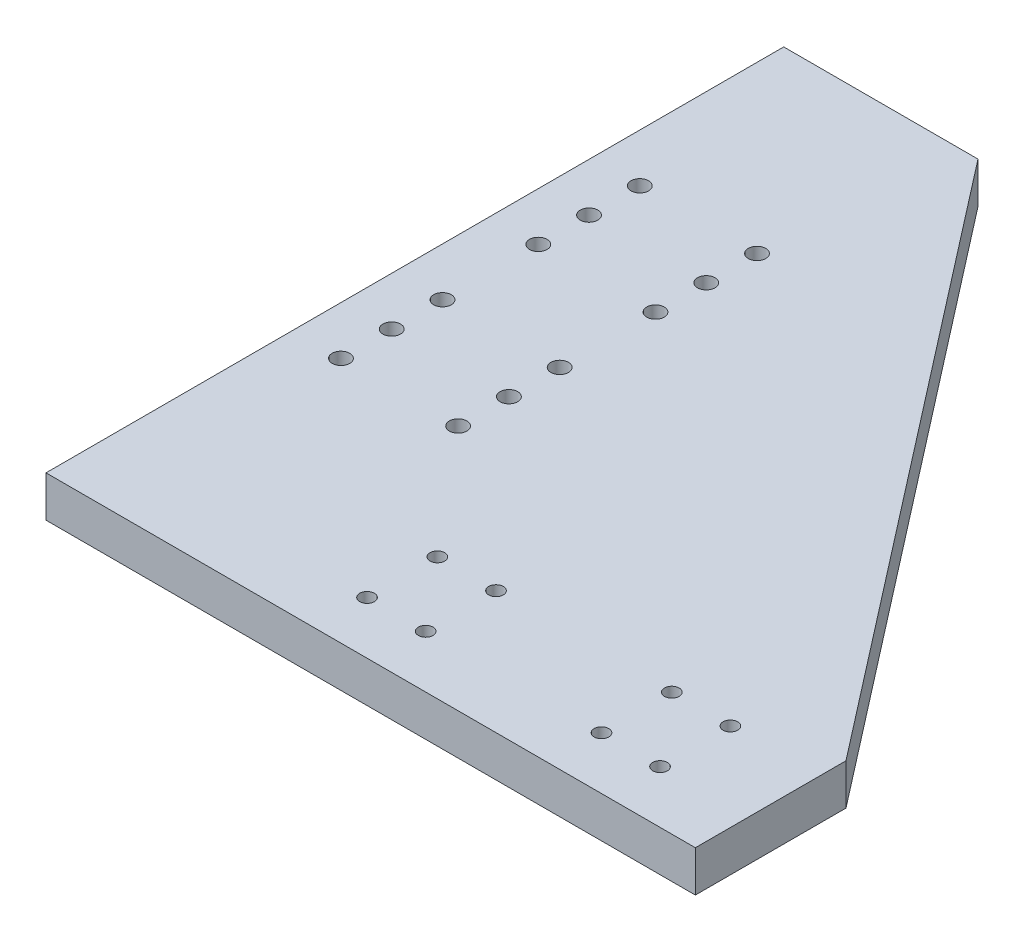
ISO-10303-21;
HEADER;
FILE_DESCRIPTION(('STEP AP214'),'2;1');
FILE_NAME('part.step','',(''),(''),'','','');
FILE_SCHEMA(('AUTOMOTIVE_DESIGN { 1 0 10303 214 1 1 1 1 }'));
ENDSEC;
DATA;
#1=APPLICATION_CONTEXT('core data for automotive mechanical design processes');
#2=APPLICATION_PROTOCOL_DEFINITION('international standard','automotive_design',2000,#1);
#3=PRODUCT_CONTEXT('',#1,'mechanical');
#4=PRODUCT('Part','Part','',(#3));
#5=PRODUCT_RELATED_PRODUCT_CATEGORY('part','',(#4));
#6=PRODUCT_DEFINITION_FORMATION('','',#4);
#7=PRODUCT_DEFINITION_CONTEXT('part definition',#1,'design');
#8=PRODUCT_DEFINITION('design','',#6,#7);
#9=PRODUCT_DEFINITION_SHAPE('','',#8);
#10=(LENGTH_UNIT() NAMED_UNIT(*) SI_UNIT(.MILLI.,.METRE.));
#11=(NAMED_UNIT(*) PLANE_ANGLE_UNIT() SI_UNIT($,.RADIAN.));
#12=(NAMED_UNIT(*) SI_UNIT($,.STERADIAN.) SOLID_ANGLE_UNIT());
#13=UNCERTAINTY_MEASURE_WITH_UNIT(LENGTH_MEASURE(1.E-05),#10,'distance_accuracy_value','');
#14=(GEOMETRIC_REPRESENTATION_CONTEXT(3) GLOBAL_UNCERTAINTY_ASSIGNED_CONTEXT((#13)) GLOBAL_UNIT_ASSIGNED_CONTEXT((#10,
#11,#12)) REPRESENTATION_CONTEXT('',''));
#15=CARTESIAN_POINT('',(0.,0.,0.));
#16=DIRECTION('',(0.,0.,1.));
#17=DIRECTION('',(1.,0.,0.));
#18=AXIS2_PLACEMENT_3D('',#15,#16,#17);
#19=CARTESIAN_POINT('',(882.49650001,88.9,399.797023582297));
#20=DIRECTION('',(-1.,0.,0.));
#21=DIRECTION('',(0.,0.,1.));
#22=AXIS2_PLACEMENT_3D('',#19,#20,#21);
#23=PLANE('',#22);
#24=DIRECTION('',(0.,0.,-1.));
#25=VECTOR('',#24,1.);
#26=CARTESIAN_POINT('',(882.49650001,0.,399.797023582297));
#27=LINE('',#26,#25);
#28=CARTESIAN_POINT('',(882.49650001,0.,726.251123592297));
#29=VERTEX_POINT('',#28);
#30=CARTESIAN_POINT('',(882.49650001,0.,399.797023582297));
#31=VERTEX_POINT('',#30);
#32=EDGE_CURVE('E130',#29,#31,#27,.T.);
#33=ORIENTED_EDGE('',*,*,#32,.T.);
#34=DIRECTION('',(0.,-1.,0.));
#35=VECTOR('',#34,1.);
#36=CARTESIAN_POINT('',(882.49650001,88.9,399.797023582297));
#37=LINE('',#36,#35);
#38=CARTESIAN_POINT('',(882.49650001,88.9,399.797023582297));
#39=VERTEX_POINT('',#38);
#40=EDGE_CURVE('E11',#39,#31,#37,.T.);
#41=ORIENTED_EDGE('',*,*,#40,.F.);
#42=DIRECTION('',(0.,0.,-1.));
#43=VECTOR('',#42,1.);
#44=CARTESIAN_POINT('',(882.49650001,88.9,399.797023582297));
#45=LINE('',#44,#43);
#46=CARTESIAN_POINT('',(882.49650001,88.9,726.251123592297));
#47=VERTEX_POINT('',#46);
#48=EDGE_CURVE('E143',#47,#39,#45,.T.);
#49=ORIENTED_EDGE('',*,*,#48,.F.);
#50=DIRECTION('',(0.,-1.,0.));
#51=VECTOR('',#50,1.);
#52=CARTESIAN_POINT('',(882.49650001,88.9,726.251123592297));
#53=LINE('',#52,#51);
#54=EDGE_CURVE('E124',#47,#29,#53,.T.);
#55=ORIENTED_EDGE('',*,*,#54,.T.);
#56=EDGE_LOOP('',(#33,#41,#49,#55));
#57=FACE_BOUND('',#56,.T.);
#58=ADVANCED_FACE('F50',(#57),#23,.F.);
#59=CARTESIAN_POINT('',(-103.79099999,88.9,-872.648876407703));
#60=DIRECTION('',(-0.790372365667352,0.,0.612626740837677));
#61=DIRECTION('',(0.612626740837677,0.,0.790372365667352));
#62=AXIS2_PLACEMENT_3D('',#59,#60,#61);
#63=PLANE('',#62);
#64=DIRECTION('',(-0.612626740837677,0.,-0.790372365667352));
#65=VECTOR('',#64,1.);
#66=CARTESIAN_POINT('',(-103.79099999,0.,-872.648876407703));
#67=LINE('',#66,#65);
#68=CARTESIAN_POINT('',(-103.79099999,0.,-872.648876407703));
#69=VERTEX_POINT('',#68);
#70=EDGE_CURVE('E133',#31,#69,#67,.T.);
#71=ORIENTED_EDGE('',*,*,#70,.T.);
#72=DIRECTION('',(0.,-1.,0.));
#73=VECTOR('',#72,1.);
#74=CARTESIAN_POINT('',(-103.79099999,88.9,-872.648876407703));
#75=LINE('',#74,#73);
#76=CARTESIAN_POINT('',(-103.79099999,88.9,-872.648876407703));
#77=VERTEX_POINT('',#76);
#78=EDGE_CURVE('E57',#77,#69,#75,.T.);
#79=ORIENTED_EDGE('',*,*,#78,.F.);
#80=DIRECTION('',(-0.612626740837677,0.,-0.790372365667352));
#81=VECTOR('',#80,1.);
#82=CARTESIAN_POINT('',(-103.79099999,88.9,-872.648876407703));
#83=LINE('',#82,#81);
#84=EDGE_CURVE('E98',#39,#77,#83,.T.);
#85=ORIENTED_EDGE('',*,*,#84,.F.);
#86=ORIENTED_EDGE('',*,*,#40,.T.);
#87=EDGE_LOOP('',(#71,#79,#85,#86));
#88=FACE_BOUND('',#87,.T.);
#89=ADVANCED_FACE('F164',(#88),#63,.F.);
#90=CARTESIAN_POINT('',(-524.87815905,88.9,-872.648876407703));
#91=DIRECTION('',(0.,0.,1.));
#92=DIRECTION('',(1.,0.,0.));
#93=AXIS2_PLACEMENT_3D('',#90,#91,#92);
#94=PLANE('',#93);
#95=DIRECTION('',(-1.,0.,0.));
#96=VECTOR('',#95,1.);
#97=CARTESIAN_POINT('',(-524.87815905,0.,-872.648876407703));
#98=LINE('',#97,#96);
#99=CARTESIAN_POINT('',(-524.87815905,0.,-872.648876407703));
#100=VERTEX_POINT('',#99);
#101=EDGE_CURVE('E111',#69,#100,#98,.T.);
#102=ORIENTED_EDGE('',*,*,#101,.T.);
#103=DIRECTION('',(0.,-1.,0.));
#104=VECTOR('',#103,1.);
#105=CARTESIAN_POINT('',(-524.87815905,88.9,-872.648876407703));
#106=LINE('',#105,#104);
#107=CARTESIAN_POINT('',(-524.87815905,88.9,-872.648876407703));
#108=VERTEX_POINT('',#107);
#109=EDGE_CURVE('E112',#108,#100,#106,.T.);
#110=ORIENTED_EDGE('',*,*,#109,.F.);
#111=DIRECTION('',(-1.,0.,0.));
#112=VECTOR('',#111,1.);
#113=CARTESIAN_POINT('',(-524.87815905,88.9,-872.648876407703));
#114=LINE('',#113,#112);
#115=EDGE_CURVE('E105',#77,#108,#114,.T.);
#116=ORIENTED_EDGE('',*,*,#115,.F.);
#117=ORIENTED_EDGE('',*,*,#78,.T.);
#118=EDGE_LOOP('',(#102,#110,#116,#117));
#119=FACE_BOUND('',#118,.T.);
#120=ADVANCED_FACE('F115',(#119),#94,.F.);
#121=CARTESIAN_POINT('',(-524.87815905,88.9,726.251123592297));
#122=DIRECTION('',(1.,0.,0.));
#123=DIRECTION('',(0.,0.,-1.));
#124=AXIS2_PLACEMENT_3D('',#121,#122,#123);
#125=PLANE('',#124);
#126=DIRECTION('',(0.,0.,1.));
#127=VECTOR('',#126,1.);
#128=CARTESIAN_POINT('',(-524.87815905,0.,726.251123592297));
#129=LINE('',#128,#127);
#130=CARTESIAN_POINT('',(-524.87815905,0.,726.251123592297));
#131=VERTEX_POINT('',#130);
#132=EDGE_CURVE('E81',#100,#131,#129,.T.);
#133=ORIENTED_EDGE('',*,*,#132,.T.);
#134=DIRECTION('',(0.,-1.,0.));
#135=VECTOR('',#134,1.);
#136=CARTESIAN_POINT('',(-524.87815905,88.9,726.251123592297));
#137=LINE('',#136,#135);
#138=CARTESIAN_POINT('',(-524.87815905,88.9,726.251123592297));
#139=VERTEX_POINT('',#138);
#140=EDGE_CURVE('E118',#139,#131,#137,.T.);
#141=ORIENTED_EDGE('',*,*,#140,.F.);
#142=DIRECTION('',(0.,0.,1.));
#143=VECTOR('',#142,1.);
#144=CARTESIAN_POINT('',(-524.87815905,88.9,726.251123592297));
#145=LINE('',#144,#143);
#146=EDGE_CURVE('E106',#108,#139,#145,.T.);
#147=ORIENTED_EDGE('',*,*,#146,.F.);
#148=ORIENTED_EDGE('',*,*,#109,.T.);
#149=EDGE_LOOP('',(#133,#141,#147,#148));
#150=FACE_BOUND('',#149,.T.);
#151=ADVANCED_FACE('F117',(#150),#125,.F.);
#152=CARTESIAN_POINT('',(882.49650001,88.9,726.251123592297));
#153=DIRECTION('',(0.,0.,-1.));
#154=DIRECTION('',(-1.,0.,0.));
#155=AXIS2_PLACEMENT_3D('',#152,#153,#154);
#156=PLANE('',#155);
#157=DIRECTION('',(1.,0.,0.));
#158=VECTOR('',#157,1.);
#159=CARTESIAN_POINT('',(882.49650001,0.,726.251123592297));
#160=LINE('',#159,#158);
#161=EDGE_CURVE('E89',#131,#29,#160,.T.);
#162=ORIENTED_EDGE('',*,*,#161,.T.);
#163=ORIENTED_EDGE('',*,*,#54,.F.);
#164=DIRECTION('',(1.,0.,0.));
#165=VECTOR('',#164,1.);
#166=CARTESIAN_POINT('',(882.49650001,88.9,726.251123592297));
#167=LINE('',#166,#165);
#168=EDGE_CURVE('E65',#139,#47,#167,.T.);
#169=ORIENTED_EDGE('',*,*,#168,.F.);
#170=ORIENTED_EDGE('',*,*,#140,.T.);
#171=EDGE_LOOP('',(#162,#163,#169,#170));
#172=FACE_BOUND('',#171,.T.);
#173=ADVANCED_FACE('F153',(#172),#156,.F.);
#174=CARTESIAN_POINT('',(0.,88.9,0.));
#175=DIRECTION('',(0.,-1.,0.));
#176=DIRECTION('',(0.,0.,-1.));
#177=AXIS2_PLACEMENT_3D('',#174,#175,#176);
#178=PLANE('',#177);
#179=CARTESIAN_POINT('',(-420.115999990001,88.9,191.72612359));
#180=DIRECTION('',(0.,1.,0.));
#181=DIRECTION('',(0.,0.,1.));
#182=AXIS2_PLACEMENT_3D('',#179,#180,#181);
#183=CIRCLE('',#182,19.05);
#184=CARTESIAN_POINT('',(-420.115999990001,88.9,210.77612359));
#185=VERTEX_POINT('',#184);
#186=EDGE_CURVE('E403',#185,#185,#183,.T.);
#187=ORIENTED_EDGE('',*,*,#186,.F.);
#188=EDGE_LOOP('',(#187));
#189=FACE_BOUND('',#188,.T.);
#190=CARTESIAN_POINT('',(-420.115999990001,88.9,-455.97387641));
#191=DIRECTION('',(0.,1.,0.));
#192=DIRECTION('',(0.,0.,1.));
#193=AXIS2_PLACEMENT_3D('',#190,#191,#192);
#194=CIRCLE('',#193,19.05);
#195=CARTESIAN_POINT('',(-420.115999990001,88.9,-436.92387641));
#196=VERTEX_POINT('',#195);
#197=EDGE_CURVE('E430',#196,#196,#194,.T.);
#198=ORIENTED_EDGE('',*,*,#197,.F.);
#199=EDGE_LOOP('',(#198));
#200=FACE_BOUND('',#199,.T.);
#201=CARTESIAN_POINT('',(-166.115999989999,88.9,-455.97387641));
#202=DIRECTION('',(0.,1.,0.));
#203=DIRECTION('',(0.,0.,1.));
#204=AXIS2_PLACEMENT_3D('',#201,#202,#203);
#205=CIRCLE('',#204,19.05);
#206=CARTESIAN_POINT('',(-166.115999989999,88.9,-436.92387641));
#207=VERTEX_POINT('',#206);
#208=EDGE_CURVE('E434',#207,#207,#205,.T.);
#209=ORIENTED_EDGE('',*,*,#208,.F.);
#210=EDGE_LOOP('',(#209));
#211=FACE_BOUND('',#210,.T.);
#212=CARTESIAN_POINT('',(-166.115999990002,88.9,81.7261235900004));
#213=DIRECTION('',(0.,1.,0.));
#214=DIRECTION('',(0.,0.,1.));
#215=AXIS2_PLACEMENT_3D('',#212,#213,#214);
#216=CIRCLE('',#215,19.0499999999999);
#217=CARTESIAN_POINT('',(-166.115999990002,88.9,100.77612359));
#218=VERTEX_POINT('',#217);
#219=EDGE_CURVE('E444',#218,#218,#216,.T.);
#220=ORIENTED_EDGE('',*,*,#219,.F.);
#221=EDGE_LOOP('',(#220));
#222=FACE_BOUND('',#221,.T.);
#223=CARTESIAN_POINT('',(-420.115999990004,88.9,81.7261235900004));
#224=DIRECTION('',(0.,1.,0.));
#225=DIRECTION('',(0.,0.,1.));
#226=AXIS2_PLACEMENT_3D('',#223,#224,#225);
#227=CIRCLE('',#226,19.05);
#228=CARTESIAN_POINT('',(-420.115999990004,88.9,100.77612359));
#229=VERTEX_POINT('',#228);
#230=EDGE_CURVE('E582',#229,#229,#227,.T.);
#231=ORIENTED_EDGE('',*,*,#230,.F.);
#232=EDGE_LOOP('',(#231));
#233=FACE_BOUND('',#232,.T.);
#234=CARTESIAN_POINT('',(-420.115999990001,88.9,-345.97387641));
#235=DIRECTION('',(0.,1.,0.));
#236=DIRECTION('',(0.,0.,1.));
#237=AXIS2_PLACEMENT_3D('',#234,#235,#236);
#238=CIRCLE('',#237,19.0500000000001);
#239=CARTESIAN_POINT('',(-420.115999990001,88.9,-326.92387641));
#240=VERTEX_POINT('',#239);
#241=EDGE_CURVE('E587',#240,#240,#238,.T.);
#242=ORIENTED_EDGE('',*,*,#241,.F.);
#243=EDGE_LOOP('',(#242));
#244=FACE_BOUND('',#243,.T.);
#245=CARTESIAN_POINT('',(-166.115999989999,88.9,-345.97387641));
#246=DIRECTION('',(0.,1.,0.));
#247=DIRECTION('',(0.,0.,1.));
#248=AXIS2_PLACEMENT_3D('',#245,#246,#247);
#249=CIRCLE('',#248,19.0500000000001);
#250=CARTESIAN_POINT('',(-166.115999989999,88.9,-326.92387641));
#251=VERTEX_POINT('',#250);
#252=EDGE_CURVE('E598',#251,#251,#249,.T.);
#253=ORIENTED_EDGE('',*,*,#252,.F.);
#254=EDGE_LOOP('',(#253));
#255=FACE_BOUND('',#254,.T.);
#256=CARTESIAN_POINT('',(-166.115999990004,88.9,-28.2738764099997));
#257=DIRECTION('',(0.,1.,0.));
#258=DIRECTION('',(0.,0.,1.));
#259=AXIS2_PLACEMENT_3D('',#256,#257,#258);
#260=CIRCLE('',#259,19.05);
#261=CARTESIAN_POINT('',(-166.115999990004,88.9,-9.22387640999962));
#262=VERTEX_POINT('',#261);
#263=EDGE_CURVE('E423',#262,#262,#260,.T.);
#264=ORIENTED_EDGE('',*,*,#263,.F.);
#265=EDGE_LOOP('',(#264));
#266=FACE_BOUND('',#265,.T.);
#267=CARTESIAN_POINT('',(691.99650001,88.9,612.222023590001));
#268=DIRECTION('',(0.,1.,0.));
#269=DIRECTION('',(0.,0.,1.));
#270=AXIS2_PLACEMENT_3D('',#267,#268,#269);
#271=CIRCLE('',#270,15.8749999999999);
#272=CARTESIAN_POINT('',(691.99650001,88.9,628.097023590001));
#273=VERTEX_POINT('',#272);
#274=EDGE_CURVE('E481',#273,#273,#271,.T.);
#275=ORIENTED_EDGE('',*,*,#274,.F.);
#276=EDGE_LOOP('',(#275));
#277=FACE_BOUND('',#276,.T.);
#278=CARTESIAN_POINT('',(56.9965000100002,88.9,612.222023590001));
#279=DIRECTION('',(0.,1.,0.));
#280=DIRECTION('',(0.,0.,1.));
#281=AXIS2_PLACEMENT_3D('',#278,#279,#280);
#282=CIRCLE('',#281,15.875);
#283=CARTESIAN_POINT('',(56.9965000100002,88.9,628.097023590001));
#284=VERTEX_POINT('',#283);
#285=EDGE_CURVE('E487',#284,#284,#282,.T.);
#286=ORIENTED_EDGE('',*,*,#285,.F.);
#287=EDGE_LOOP('',(#286));
#288=FACE_BOUND('',#287,.T.);
#289=CARTESIAN_POINT('',(56.9965000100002,88.9,459.822023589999));
#290=DIRECTION('',(0.,1.,0.));
#291=DIRECTION('',(0.,0.,1.));
#292=AXIS2_PLACEMENT_3D('',#289,#290,#291);
#293=CIRCLE('',#292,15.875);
#294=CARTESIAN_POINT('',(56.9965000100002,88.9,475.697023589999));
#295=VERTEX_POINT('',#294);
#296=EDGE_CURVE('E500',#295,#295,#293,.T.);
#297=ORIENTED_EDGE('',*,*,#296,.F.);
#298=EDGE_LOOP('',(#297));
#299=FACE_BOUND('',#298,.T.);
#300=CARTESIAN_POINT('',(564.99650001,88.9,459.82202359));
#301=DIRECTION('',(0.,1.,0.));
#302=DIRECTION('',(0.,0.,1.));
#303=AXIS2_PLACEMENT_3D('',#300,#301,#302);
#304=CIRCLE('',#303,15.875);
#305=CARTESIAN_POINT('',(564.99650001,88.9,475.69702359));
#306=VERTEX_POINT('',#305);
#307=EDGE_CURVE('E455',#306,#306,#304,.T.);
#308=ORIENTED_EDGE('',*,*,#307,.F.);
#309=EDGE_LOOP('',(#308));
#310=FACE_BOUND('',#309,.T.);
#311=CARTESIAN_POINT('',(564.99650001,88.9,612.222023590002));
#312=DIRECTION('',(0.,1.,0.));
#313=DIRECTION('',(0.,0.,1.));
#314=AXIS2_PLACEMENT_3D('',#311,#312,#313);
#315=CIRCLE('',#314,15.8749999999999);
#316=CARTESIAN_POINT('',(564.99650001,88.9,628.097023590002));
#317=VERTEX_POINT('',#316);
#318=EDGE_CURVE('E454',#317,#317,#315,.T.);
#319=ORIENTED_EDGE('',*,*,#318,.F.);
#320=EDGE_LOOP('',(#319));
#321=FACE_BOUND('',#320,.T.);
#322=CARTESIAN_POINT('',(183.99650001,88.9,612.222023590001));
#323=DIRECTION('',(0.,1.,0.));
#324=DIRECTION('',(0.,0.,1.));
#325=AXIS2_PLACEMENT_3D('',#322,#323,#324);
#326=CIRCLE('',#325,15.875);
#327=CARTESIAN_POINT('',(183.99650001,88.9,628.097023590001));
#328=VERTEX_POINT('',#327);
#329=EDGE_CURVE('E463',#328,#328,#326,.T.);
#330=ORIENTED_EDGE('',*,*,#329,.F.);
#331=EDGE_LOOP('',(#330));
#332=FACE_BOUND('',#331,.T.);
#333=CARTESIAN_POINT('',(183.99650001,88.9,459.822023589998));
#334=DIRECTION('',(0.,1.,0.));
#335=DIRECTION('',(0.,0.,1.));
#336=AXIS2_PLACEMENT_3D('',#333,#334,#335);
#337=CIRCLE('',#336,15.8750000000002);
#338=CARTESIAN_POINT('',(183.99650001,88.9,475.697023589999));
#339=VERTEX_POINT('',#338);
#340=EDGE_CURVE('E466',#339,#339,#337,.T.);
#341=ORIENTED_EDGE('',*,*,#340,.F.);
#342=EDGE_LOOP('',(#341));
#343=FACE_BOUND('',#342,.T.);
#344=CARTESIAN_POINT('',(-166.115999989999,88.9,191.72612359));
#345=DIRECTION('',(0.,1.,0.));
#346=DIRECTION('',(0.,0.,1.));
#347=AXIS2_PLACEMENT_3D('',#344,#345,#346);
#348=CIRCLE('',#347,19.05);
#349=CARTESIAN_POINT('',(-166.115999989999,88.9,210.77612359));
#350=VERTEX_POINT('',#349);
#351=EDGE_CURVE('E406',#350,#350,#348,.T.);
#352=ORIENTED_EDGE('',*,*,#351,.F.);
#353=EDGE_LOOP('',(#352));
#354=FACE_BOUND('',#353,.T.);
#355=CARTESIAN_POINT('',(-420.115999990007,88.9,-28.2738764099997));
#356=DIRECTION('',(0.,1.,0.));
#357=DIRECTION('',(0.,0.,1.));
#358=AXIS2_PLACEMENT_3D('',#355,#356,#357);
#359=CIRCLE('',#358,19.0499999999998);
#360=CARTESIAN_POINT('',(-420.115999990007,88.9,-9.22387640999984));
#361=VERTEX_POINT('',#360);
#362=EDGE_CURVE('E565',#361,#361,#359,.T.);
#363=ORIENTED_EDGE('',*,*,#362,.F.);
#364=EDGE_LOOP('',(#363));
#365=FACE_BOUND('',#364,.T.);
#366=CARTESIAN_POINT('',(-420.11599999,88.9,-235.97387641));
#367=DIRECTION('',(0.,1.,0.));
#368=DIRECTION('',(0.,0.,1.));
#369=AXIS2_PLACEMENT_3D('',#366,#367,#368);
#370=CIRCLE('',#369,19.0500000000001);
#371=CARTESIAN_POINT('',(-420.11599999,88.9,-216.92387641));
#372=VERTEX_POINT('',#371);
#373=EDGE_CURVE('E567',#372,#372,#370,.T.);
#374=ORIENTED_EDGE('',*,*,#373,.F.);
#375=EDGE_LOOP('',(#374));
#376=FACE_BOUND('',#375,.T.);
#377=CARTESIAN_POINT('',(-166.115999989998,88.9,-235.97387641));
#378=DIRECTION('',(0.,1.,0.));
#379=DIRECTION('',(0.,0.,1.));
#380=AXIS2_PLACEMENT_3D('',#377,#378,#379);
#381=CIRCLE('',#380,19.0499999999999);
#382=CARTESIAN_POINT('',(-166.115999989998,88.9,-216.92387641));
#383=VERTEX_POINT('',#382);
#384=EDGE_CURVE('E569',#383,#383,#381,.T.);
#385=ORIENTED_EDGE('',*,*,#384,.F.);
#386=EDGE_LOOP('',(#385));
#387=FACE_BOUND('',#386,.T.);
#388=CARTESIAN_POINT('',(691.99650001,88.9,459.822023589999));
#389=DIRECTION('',(0.,1.,0.));
#390=DIRECTION('',(0.,0.,1.));
#391=AXIS2_PLACEMENT_3D('',#388,#389,#390);
#392=CIRCLE('',#391,15.8749999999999);
#393=CARTESIAN_POINT('',(691.99650001,88.9,475.697023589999));
#394=VERTEX_POINT('',#393);
#395=EDGE_CURVE('E134',#394,#394,#392,.T.);
#396=ORIENTED_EDGE('',*,*,#395,.F.);
#397=EDGE_LOOP('',(#396));
#398=FACE_BOUND('',#397,.T.);
#399=ORIENTED_EDGE('',*,*,#48,.T.);
#400=ORIENTED_EDGE('',*,*,#84,.T.);
#401=ORIENTED_EDGE('',*,*,#115,.T.);
#402=ORIENTED_EDGE('',*,*,#146,.T.);
#403=ORIENTED_EDGE('',*,*,#168,.T.);
#404=EDGE_LOOP('',(#399,#400,#401,#402,#403));
#405=FACE_BOUND('',#404,.T.);
#406=ADVANCED_FACE('F102',(#189,#200,#211,#222,#233,#244,#255,#266,#277,#288,#299,#310,#321,
#332,#343,#354,#365,#376,#387,#398,#405),#178,.F.);
#407=CARTESIAN_POINT('',(0.,0.,0.));
#408=DIRECTION('',(0.,-1.,0.));
#409=DIRECTION('',(0.,0.,-1.));
#410=AXIS2_PLACEMENT_3D('',#407,#408,#409);
#411=PLANE('',#410);
#412=CARTESIAN_POINT('',(-420.115999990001,0.,191.72612359));
#413=DIRECTION('',(0.,1.,0.));
#414=DIRECTION('',(0.,0.,1.));
#415=AXIS2_PLACEMENT_3D('',#412,#413,#414);
#416=CIRCLE('',#415,19.05);
#417=CARTESIAN_POINT('',(-420.115999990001,0.,210.77612359));
#418=VERTEX_POINT('',#417);
#419=EDGE_CURVE('E407',#418,#418,#416,.T.);
#420=ORIENTED_EDGE('',*,*,#419,.T.);
#421=EDGE_LOOP('',(#420));
#422=FACE_BOUND('',#421,.T.);
#423=CARTESIAN_POINT('',(-420.115999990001,0.,-455.97387641));
#424=DIRECTION('',(0.,1.,0.));
#425=DIRECTION('',(0.,0.,1.));
#426=AXIS2_PLACEMENT_3D('',#423,#424,#425);
#427=CIRCLE('',#426,19.05);
#428=CARTESIAN_POINT('',(-420.115999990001,0.,-436.92387641));
#429=VERTEX_POINT('',#428);
#430=EDGE_CURVE('E416',#429,#429,#427,.T.);
#431=ORIENTED_EDGE('',*,*,#430,.T.);
#432=EDGE_LOOP('',(#431));
#433=FACE_BOUND('',#432,.T.);
#434=CARTESIAN_POINT('',(-166.115999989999,0.,-455.97387641));
#435=DIRECTION('',(0.,1.,0.));
#436=DIRECTION('',(0.,0.,1.));
#437=AXIS2_PLACEMENT_3D('',#434,#435,#436);
#438=CIRCLE('',#437,19.05);
#439=CARTESIAN_POINT('',(-166.115999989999,0.,-436.92387641));
#440=VERTEX_POINT('',#439);
#441=EDGE_CURVE('E431',#440,#440,#438,.T.);
#442=ORIENTED_EDGE('',*,*,#441,.T.);
#443=EDGE_LOOP('',(#442));
#444=FACE_BOUND('',#443,.T.);
#445=CARTESIAN_POINT('',(-166.115999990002,0.,81.7261235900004));
#446=DIRECTION('',(0.,1.,0.));
#447=DIRECTION('',(0.,0.,1.));
#448=AXIS2_PLACEMENT_3D('',#445,#446,#447);
#449=CIRCLE('',#448,19.0499999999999);
#450=CARTESIAN_POINT('',(-166.115999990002,0.,100.77612359));
#451=VERTEX_POINT('',#450);
#452=EDGE_CURVE('E438',#451,#451,#449,.T.);
#453=ORIENTED_EDGE('',*,*,#452,.T.);
#454=EDGE_LOOP('',(#453));
#455=FACE_BOUND('',#454,.T.);
#456=CARTESIAN_POINT('',(-420.115999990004,0.,81.7261235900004));
#457=DIRECTION('',(0.,1.,0.));
#458=DIRECTION('',(0.,0.,1.));
#459=AXIS2_PLACEMENT_3D('',#456,#457,#458);
#460=CIRCLE('',#459,19.05);
#461=CARTESIAN_POINT('',(-420.115999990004,0.,100.77612359));
#462=VERTEX_POINT('',#461);
#463=EDGE_CURVE('E449',#462,#462,#460,.T.);
#464=ORIENTED_EDGE('',*,*,#463,.T.);
#465=EDGE_LOOP('',(#464));
#466=FACE_BOUND('',#465,.T.);
#467=CARTESIAN_POINT('',(-420.115999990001,0.,-345.97387641));
#468=DIRECTION('',(0.,1.,0.));
#469=DIRECTION('',(0.,0.,1.));
#470=AXIS2_PLACEMENT_3D('',#467,#468,#469);
#471=CIRCLE('',#470,19.0500000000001);
#472=CARTESIAN_POINT('',(-420.115999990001,0.,-326.92387641));
#473=VERTEX_POINT('',#472);
#474=EDGE_CURVE('E588',#473,#473,#471,.T.);
#475=ORIENTED_EDGE('',*,*,#474,.T.);
#476=EDGE_LOOP('',(#475));
#477=FACE_BOUND('',#476,.T.);
#478=CARTESIAN_POINT('',(-166.115999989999,0.,-345.97387641));
#479=DIRECTION('',(0.,1.,0.));
#480=DIRECTION('',(0.,0.,1.));
#481=AXIS2_PLACEMENT_3D('',#478,#479,#480);
#482=CIRCLE('',#481,19.0500000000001);
#483=CARTESIAN_POINT('',(-166.115999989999,0.,-326.92387641));
#484=VERTEX_POINT('',#483);
#485=EDGE_CURVE('E592',#484,#484,#482,.T.);
#486=ORIENTED_EDGE('',*,*,#485,.T.);
#487=EDGE_LOOP('',(#486));
#488=FACE_BOUND('',#487,.T.);
#489=CARTESIAN_POINT('',(-166.115999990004,0.,-28.2738764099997));
#490=DIRECTION('',(0.,1.,0.));
#491=DIRECTION('',(0.,0.,1.));
#492=AXIS2_PLACEMENT_3D('',#489,#490,#491);
#493=CIRCLE('',#492,19.05);
#494=CARTESIAN_POINT('',(-166.115999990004,0.,-9.22387640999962));
#495=VERTEX_POINT('',#494);
#496=EDGE_CURVE('E601',#495,#495,#493,.T.);
#497=ORIENTED_EDGE('',*,*,#496,.T.);
#498=EDGE_LOOP('',(#497));
#499=FACE_BOUND('',#498,.T.);
#500=CARTESIAN_POINT('',(691.99650001,0.,612.222023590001));
#501=DIRECTION('',(0.,1.,0.));
#502=DIRECTION('',(0.,0.,1.));
#503=AXIS2_PLACEMENT_3D('',#500,#501,#502);
#504=CIRCLE('',#503,15.8749999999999);
#505=CARTESIAN_POINT('',(691.99650001,0.,628.097023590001));
#506=VERTEX_POINT('',#505);
#507=EDGE_CURVE('E478',#506,#506,#504,.T.);
#508=ORIENTED_EDGE('',*,*,#507,.T.);
#509=EDGE_LOOP('',(#508));
#510=FACE_BOUND('',#509,.T.);
#511=CARTESIAN_POINT('',(56.9965000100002,0.,612.222023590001));
#512=DIRECTION('',(0.,1.,0.));
#513=DIRECTION('',(0.,0.,1.));
#514=AXIS2_PLACEMENT_3D('',#511,#512,#513);
#515=CIRCLE('',#514,15.875);
#516=CARTESIAN_POINT('',(56.9965000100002,0.,628.097023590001));
#517=VERTEX_POINT('',#516);
#518=EDGE_CURVE('E484',#517,#517,#515,.T.);
#519=ORIENTED_EDGE('',*,*,#518,.T.);
#520=EDGE_LOOP('',(#519));
#521=FACE_BOUND('',#520,.T.);
#522=CARTESIAN_POINT('',(56.9965000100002,0.,459.822023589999));
#523=DIRECTION('',(0.,1.,0.));
#524=DIRECTION('',(0.,0.,1.));
#525=AXIS2_PLACEMENT_3D('',#522,#523,#524);
#526=CIRCLE('',#525,15.875);
#527=CARTESIAN_POINT('',(56.9965000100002,0.,475.697023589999));
#528=VERTEX_POINT('',#527);
#529=EDGE_CURVE('E492',#528,#528,#526,.T.);
#530=ORIENTED_EDGE('',*,*,#529,.T.);
#531=EDGE_LOOP('',(#530));
#532=FACE_BOUND('',#531,.T.);
#533=CARTESIAN_POINT('',(564.99650001,0.,459.82202359));
#534=DIRECTION('',(0.,1.,0.));
#535=DIRECTION('',(0.,0.,1.));
#536=AXIS2_PLACEMENT_3D('',#533,#534,#535);
#537=CIRCLE('',#536,15.875);
#538=CARTESIAN_POINT('',(564.99650001,0.,475.69702359));
#539=VERTEX_POINT('',#538);
#540=EDGE_CURVE('E503',#539,#539,#537,.T.);
#541=ORIENTED_EDGE('',*,*,#540,.T.);
#542=EDGE_LOOP('',(#541));
#543=FACE_BOUND('',#542,.T.);
#544=CARTESIAN_POINT('',(564.99650001,0.,612.222023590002));
#545=DIRECTION('',(0.,1.,0.));
#546=DIRECTION('',(0.,0.,1.));
#547=AXIS2_PLACEMENT_3D('',#544,#545,#546);
#548=CIRCLE('',#547,15.8749999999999);
#549=CARTESIAN_POINT('',(564.99650001,0.,628.097023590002));
#550=VERTEX_POINT('',#549);
#551=EDGE_CURVE('E447',#550,#550,#548,.T.);
#552=ORIENTED_EDGE('',*,*,#551,.T.);
#553=EDGE_LOOP('',(#552));
#554=FACE_BOUND('',#553,.T.);
#555=CARTESIAN_POINT('',(183.99650001,0.,612.222023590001));
#556=DIRECTION('',(0.,1.,0.));
#557=DIRECTION('',(0.,0.,1.));
#558=AXIS2_PLACEMENT_3D('',#555,#556,#557);
#559=CIRCLE('',#558,15.875);
#560=CARTESIAN_POINT('',(183.99650001,0.,628.097023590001));
#561=VERTEX_POINT('',#560);
#562=EDGE_CURVE('E460',#561,#561,#559,.T.);
#563=ORIENTED_EDGE('',*,*,#562,.T.);
#564=EDGE_LOOP('',(#563));
#565=FACE_BOUND('',#564,.T.);
#566=CARTESIAN_POINT('',(183.99650001,0.,459.822023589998));
#567=DIRECTION('',(0.,1.,0.));
#568=DIRECTION('',(0.,0.,1.));
#569=AXIS2_PLACEMENT_3D('',#566,#567,#568);
#570=CIRCLE('',#569,15.8750000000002);
#571=CARTESIAN_POINT('',(183.99650001,0.,475.697023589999));
#572=VERTEX_POINT('',#571);
#573=EDGE_CURVE('E461',#572,#572,#570,.T.);
#574=ORIENTED_EDGE('',*,*,#573,.T.);
#575=EDGE_LOOP('',(#574));
#576=FACE_BOUND('',#575,.T.);
#577=CARTESIAN_POINT('',(-166.115999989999,0.,191.72612359));
#578=DIRECTION('',(0.,1.,0.));
#579=DIRECTION('',(0.,0.,1.));
#580=AXIS2_PLACEMENT_3D('',#577,#578,#579);
#581=CIRCLE('',#580,19.05);
#582=CARTESIAN_POINT('',(-166.115999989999,0.,210.77612359));
#583=VERTEX_POINT('',#582);
#584=EDGE_CURVE('E418',#583,#583,#581,.T.);
#585=ORIENTED_EDGE('',*,*,#584,.T.);
#586=EDGE_LOOP('',(#585));
#587=FACE_BOUND('',#586,.T.);
#588=CARTESIAN_POINT('',(-420.115999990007,0.,-28.2738764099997));
#589=DIRECTION('',(0.,1.,0.));
#590=DIRECTION('',(0.,0.,1.));
#591=AXIS2_PLACEMENT_3D('',#588,#589,#590);
#592=CIRCLE('',#591,19.0499999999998);
#593=CARTESIAN_POINT('',(-420.115999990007,0.,-9.22387640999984));
#594=VERTEX_POINT('',#593);
#595=EDGE_CURVE('E606',#594,#594,#592,.T.);
#596=ORIENTED_EDGE('',*,*,#595,.T.);
#597=EDGE_LOOP('',(#596));
#598=FACE_BOUND('',#597,.T.);
#599=CARTESIAN_POINT('',(-420.11599999,0.,-235.97387641));
#600=DIRECTION('',(0.,1.,0.));
#601=DIRECTION('',(0.,0.,1.));
#602=AXIS2_PLACEMENT_3D('',#599,#600,#601);
#603=CIRCLE('',#602,19.0500000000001);
#604=CARTESIAN_POINT('',(-420.11599999,0.,-216.92387641));
#605=VERTEX_POINT('',#604);
#606=EDGE_CURVE('E616',#605,#605,#603,.T.);
#607=ORIENTED_EDGE('',*,*,#606,.T.);
#608=EDGE_LOOP('',(#607));
#609=FACE_BOUND('',#608,.T.);
#610=CARTESIAN_POINT('',(-166.115999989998,0.,-235.97387641));
#611=DIRECTION('',(0.,1.,0.));
#612=DIRECTION('',(0.,0.,1.));
#613=AXIS2_PLACEMENT_3D('',#610,#611,#612);
#614=CIRCLE('',#613,19.0499999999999);
#615=CARTESIAN_POINT('',(-166.115999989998,0.,-216.92387641));
#616=VERTEX_POINT('',#615);
#617=EDGE_CURVE('E573',#616,#616,#614,.T.);
#618=ORIENTED_EDGE('',*,*,#617,.T.);
#619=EDGE_LOOP('',(#618));
#620=FACE_BOUND('',#619,.T.);
#621=CARTESIAN_POINT('',(691.99650001,0.,459.822023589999));
#622=DIRECTION('',(0.,1.,0.));
#623=DIRECTION('',(0.,0.,1.));
#624=AXIS2_PLACEMENT_3D('',#621,#622,#623);
#625=CIRCLE('',#624,15.8749999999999);
#626=CARTESIAN_POINT('',(691.99650001,0.,475.697023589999));
#627=VERTEX_POINT('',#626);
#628=EDGE_CURVE('E477',#627,#627,#625,.T.);
#629=ORIENTED_EDGE('',*,*,#628,.T.);
#630=EDGE_LOOP('',(#629));
#631=FACE_BOUND('',#630,.T.);
#632=ORIENTED_EDGE('',*,*,#32,.F.);
#633=ORIENTED_EDGE('',*,*,#161,.F.);
#634=ORIENTED_EDGE('',*,*,#132,.F.);
#635=ORIENTED_EDGE('',*,*,#101,.F.);
#636=ORIENTED_EDGE('',*,*,#70,.F.);
#637=EDGE_LOOP('',(#632,#633,#634,#635,#636));
#638=FACE_BOUND('',#637,.T.);
#639=ADVANCED_FACE('F149',(#422,#433,#444,#455,#466,#477,#488,#499,#510,#521,#532,#543,#554,
#565,#576,#587,#598,#609,#620,#631,#638),#411,.T.);
#640=CARTESIAN_POINT('',(691.99650001,88.9,459.822023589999));
#641=DIRECTION('',(0.,-1.,0.));
#642=DIRECTION('',(0.,0.,-1.));
#643=AXIS2_PLACEMENT_3D('',#640,#641,#642);
#644=CYLINDRICAL_SURFACE('',#643,15.8749999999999);
#645=ORIENTED_EDGE('',*,*,#395,.T.);
#646=EDGE_LOOP('',(#645));
#647=FACE_BOUND('',#646,.T.);
#648=ORIENTED_EDGE('',*,*,#628,.F.);
#649=EDGE_LOOP('',(#648));
#650=FACE_BOUND('',#649,.T.);
#651=ADVANCED_FACE('F199',(#647,#650),#644,.F.);
#652=CARTESIAN_POINT('',(-166.115999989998,88.9,-235.97387641));
#653=DIRECTION('',(0.,-1.,0.));
#654=DIRECTION('',(0.,0.,-1.));
#655=AXIS2_PLACEMENT_3D('',#652,#653,#654);
#656=CYLINDRICAL_SURFACE('',#655,19.0499999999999);
#657=ORIENTED_EDGE('',*,*,#384,.T.);
#658=EDGE_LOOP('',(#657));
#659=FACE_BOUND('',#658,.T.);
#660=ORIENTED_EDGE('',*,*,#617,.F.);
#661=EDGE_LOOP('',(#660));
#662=FACE_BOUND('',#661,.T.);
#663=ADVANCED_FACE('F207',(#659,#662),#656,.F.);
#664=CARTESIAN_POINT('',(-420.11599999,88.9,-235.97387641));
#665=DIRECTION('',(0.,-1.,0.));
#666=DIRECTION('',(0.,0.,-1.));
#667=AXIS2_PLACEMENT_3D('',#664,#665,#666);
#668=CYLINDRICAL_SURFACE('',#667,19.0500000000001);
#669=ORIENTED_EDGE('',*,*,#373,.T.);
#670=EDGE_LOOP('',(#669));
#671=FACE_BOUND('',#670,.T.);
#672=ORIENTED_EDGE('',*,*,#606,.F.);
#673=EDGE_LOOP('',(#672));
#674=FACE_BOUND('',#673,.T.);
#675=ADVANCED_FACE('F218',(#671,#674),#668,.F.);
#676=CARTESIAN_POINT('',(-420.115999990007,88.9,-28.2738764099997));
#677=DIRECTION('',(0.,-1.,0.));
#678=DIRECTION('',(0.,0.,-1.));
#679=AXIS2_PLACEMENT_3D('',#676,#677,#678);
#680=CYLINDRICAL_SURFACE('',#679,19.0499999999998);
#681=ORIENTED_EDGE('',*,*,#362,.T.);
#682=EDGE_LOOP('',(#681));
#683=FACE_BOUND('',#682,.T.);
#684=ORIENTED_EDGE('',*,*,#595,.F.);
#685=EDGE_LOOP('',(#684));
#686=FACE_BOUND('',#685,.T.);
#687=ADVANCED_FACE('F230',(#683,#686),#680,.F.);
#688=CARTESIAN_POINT('',(-166.115999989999,88.9,191.72612359));
#689=DIRECTION('',(0.,-1.,0.));
#690=DIRECTION('',(0.,0.,-1.));
#691=AXIS2_PLACEMENT_3D('',#688,#689,#690);
#692=CYLINDRICAL_SURFACE('',#691,19.05);
#693=ORIENTED_EDGE('',*,*,#351,.T.);
#694=EDGE_LOOP('',(#693));
#695=FACE_BOUND('',#694,.T.);
#696=ORIENTED_EDGE('',*,*,#584,.F.);
#697=EDGE_LOOP('',(#696));
#698=FACE_BOUND('',#697,.T.);
#699=ADVANCED_FACE('F239',(#695,#698),#692,.F.);
#700=CARTESIAN_POINT('',(183.99650001,88.9,459.822023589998));
#701=DIRECTION('',(0.,-1.,0.));
#702=DIRECTION('',(0.,0.,-1.));
#703=AXIS2_PLACEMENT_3D('',#700,#701,#702);
#704=CYLINDRICAL_SURFACE('',#703,15.8750000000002);
#705=ORIENTED_EDGE('',*,*,#340,.T.);
#706=EDGE_LOOP('',(#705));
#707=FACE_BOUND('',#706,.T.);
#708=ORIENTED_EDGE('',*,*,#573,.F.);
#709=EDGE_LOOP('',(#708));
#710=FACE_BOUND('',#709,.T.);
#711=ADVANCED_FACE('F246',(#707,#710),#704,.F.);
#712=CARTESIAN_POINT('',(183.99650001,88.9,612.222023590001));
#713=DIRECTION('',(0.,-1.,0.));
#714=DIRECTION('',(0.,0.,-1.));
#715=AXIS2_PLACEMENT_3D('',#712,#713,#714);
#716=CYLINDRICAL_SURFACE('',#715,15.875);
#717=ORIENTED_EDGE('',*,*,#329,.T.);
#718=EDGE_LOOP('',(#717));
#719=FACE_BOUND('',#718,.T.);
#720=ORIENTED_EDGE('',*,*,#562,.F.);
#721=EDGE_LOOP('',(#720));
#722=FACE_BOUND('',#721,.T.);
#723=ADVANCED_FACE('F259',(#719,#722),#716,.F.);
#724=CARTESIAN_POINT('',(564.99650001,88.9,612.222023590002));
#725=DIRECTION('',(0.,-1.,0.));
#726=DIRECTION('',(0.,0.,-1.));
#727=AXIS2_PLACEMENT_3D('',#724,#725,#726);
#728=CYLINDRICAL_SURFACE('',#727,15.8749999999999);
#729=ORIENTED_EDGE('',*,*,#318,.T.);
#730=EDGE_LOOP('',(#729));
#731=FACE_BOUND('',#730,.T.);
#732=ORIENTED_EDGE('',*,*,#551,.F.);
#733=EDGE_LOOP('',(#732));
#734=FACE_BOUND('',#733,.T.);
#735=ADVANCED_FACE('F267',(#731,#734),#728,.F.);
#736=CARTESIAN_POINT('',(564.99650001,88.9,459.82202359));
#737=DIRECTION('',(0.,-1.,0.));
#738=DIRECTION('',(0.,0.,-1.));
#739=AXIS2_PLACEMENT_3D('',#736,#737,#738);
#740=CYLINDRICAL_SURFACE('',#739,15.875);
#741=ORIENTED_EDGE('',*,*,#307,.T.);
#742=EDGE_LOOP('',(#741));
#743=FACE_BOUND('',#742,.T.);
#744=ORIENTED_EDGE('',*,*,#540,.F.);
#745=EDGE_LOOP('',(#744));
#746=FACE_BOUND('',#745,.T.);
#747=ADVANCED_FACE('F276',(#743,#746),#740,.F.);
#748=CARTESIAN_POINT('',(56.9965000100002,88.9,459.822023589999));
#749=DIRECTION('',(0.,-1.,0.));
#750=DIRECTION('',(0.,0.,-1.));
#751=AXIS2_PLACEMENT_3D('',#748,#749,#750);
#752=CYLINDRICAL_SURFACE('',#751,15.875);
#753=ORIENTED_EDGE('',*,*,#296,.T.);
#754=EDGE_LOOP('',(#753));
#755=FACE_BOUND('',#754,.T.);
#756=ORIENTED_EDGE('',*,*,#529,.F.);
#757=EDGE_LOOP('',(#756));
#758=FACE_BOUND('',#757,.T.);
#759=ADVANCED_FACE('F286',(#755,#758),#752,.F.);
#760=CARTESIAN_POINT('',(56.9965000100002,88.9,612.222023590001));
#761=DIRECTION('',(0.,-1.,0.));
#762=DIRECTION('',(0.,0.,-1.));
#763=AXIS2_PLACEMENT_3D('',#760,#761,#762);
#764=CYLINDRICAL_SURFACE('',#763,15.875);
#765=ORIENTED_EDGE('',*,*,#285,.T.);
#766=EDGE_LOOP('',(#765));
#767=FACE_BOUND('',#766,.T.);
#768=ORIENTED_EDGE('',*,*,#518,.F.);
#769=EDGE_LOOP('',(#768));
#770=FACE_BOUND('',#769,.T.);
#771=ADVANCED_FACE('F300',(#767,#770),#764,.F.);
#772=CARTESIAN_POINT('',(691.99650001,88.9,612.222023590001));
#773=DIRECTION('',(0.,-1.,0.));
#774=DIRECTION('',(0.,0.,-1.));
#775=AXIS2_PLACEMENT_3D('',#772,#773,#774);
#776=CYLINDRICAL_SURFACE('',#775,15.8749999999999);
#777=ORIENTED_EDGE('',*,*,#274,.T.);
#778=EDGE_LOOP('',(#777));
#779=FACE_BOUND('',#778,.T.);
#780=ORIENTED_EDGE('',*,*,#507,.F.);
#781=EDGE_LOOP('',(#780));
#782=FACE_BOUND('',#781,.T.);
#783=ADVANCED_FACE('F310',(#779,#782),#776,.F.);
#784=CARTESIAN_POINT('',(-166.115999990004,88.9,-28.2738764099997));
#785=DIRECTION('',(0.,-1.,0.));
#786=DIRECTION('',(0.,0.,-1.));
#787=AXIS2_PLACEMENT_3D('',#784,#785,#786);
#788=CYLINDRICAL_SURFACE('',#787,19.05);
#789=ORIENTED_EDGE('',*,*,#263,.T.);
#790=EDGE_LOOP('',(#789));
#791=FACE_BOUND('',#790,.T.);
#792=ORIENTED_EDGE('',*,*,#496,.F.);
#793=EDGE_LOOP('',(#792));
#794=FACE_BOUND('',#793,.T.);
#795=ADVANCED_FACE('F317',(#791,#794),#788,.F.);
#796=CARTESIAN_POINT('',(-166.115999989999,88.9,-345.97387641));
#797=DIRECTION('',(0.,-1.,0.));
#798=DIRECTION('',(0.,0.,-1.));
#799=AXIS2_PLACEMENT_3D('',#796,#797,#798);
#800=CYLINDRICAL_SURFACE('',#799,19.0500000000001);
#801=ORIENTED_EDGE('',*,*,#252,.T.);
#802=EDGE_LOOP('',(#801));
#803=FACE_BOUND('',#802,.T.);
#804=ORIENTED_EDGE('',*,*,#485,.F.);
#805=EDGE_LOOP('',(#804));
#806=FACE_BOUND('',#805,.T.);
#807=ADVANCED_FACE('F328',(#803,#806),#800,.F.);
#808=CARTESIAN_POINT('',(-420.115999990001,88.9,-345.97387641));
#809=DIRECTION('',(0.,-1.,0.));
#810=DIRECTION('',(0.,0.,-1.));
#811=AXIS2_PLACEMENT_3D('',#808,#809,#810);
#812=CYLINDRICAL_SURFACE('',#811,19.0500000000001);
#813=ORIENTED_EDGE('',*,*,#241,.T.);
#814=EDGE_LOOP('',(#813));
#815=FACE_BOUND('',#814,.T.);
#816=ORIENTED_EDGE('',*,*,#474,.F.);
#817=EDGE_LOOP('',(#816));
#818=FACE_BOUND('',#817,.T.);
#819=ADVANCED_FACE('F340',(#815,#818),#812,.F.);
#820=CARTESIAN_POINT('',(-420.115999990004,88.9,81.7261235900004));
#821=DIRECTION('',(0.,-1.,0.));
#822=DIRECTION('',(0.,0.,-1.));
#823=AXIS2_PLACEMENT_3D('',#820,#821,#822);
#824=CYLINDRICAL_SURFACE('',#823,19.05);
#825=ORIENTED_EDGE('',*,*,#230,.T.);
#826=EDGE_LOOP('',(#825));
#827=FACE_BOUND('',#826,.T.);
#828=ORIENTED_EDGE('',*,*,#463,.F.);
#829=EDGE_LOOP('',(#828));
#830=FACE_BOUND('',#829,.T.);
#831=ADVANCED_FACE('F349',(#827,#830),#824,.F.);
#832=CARTESIAN_POINT('',(-166.115999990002,88.9,81.7261235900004));
#833=DIRECTION('',(0.,-1.,0.));
#834=DIRECTION('',(0.,0.,-1.));
#835=AXIS2_PLACEMENT_3D('',#832,#833,#834);
#836=CYLINDRICAL_SURFACE('',#835,19.0499999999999);
#837=ORIENTED_EDGE('',*,*,#219,.T.);
#838=EDGE_LOOP('',(#837));
#839=FACE_BOUND('',#838,.T.);
#840=ORIENTED_EDGE('',*,*,#452,.F.);
#841=EDGE_LOOP('',(#840));
#842=FACE_BOUND('',#841,.T.);
#843=ADVANCED_FACE('F356',(#839,#842),#836,.F.);
#844=CARTESIAN_POINT('',(-166.115999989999,88.9,-455.97387641));
#845=DIRECTION('',(0.,-1.,0.));
#846=DIRECTION('',(0.,0.,-1.));
#847=AXIS2_PLACEMENT_3D('',#844,#845,#846);
#848=CYLINDRICAL_SURFACE('',#847,19.05);
#849=ORIENTED_EDGE('',*,*,#208,.T.);
#850=EDGE_LOOP('',(#849));
#851=FACE_BOUND('',#850,.T.);
#852=ORIENTED_EDGE('',*,*,#441,.F.);
#853=EDGE_LOOP('',(#852));
#854=FACE_BOUND('',#853,.T.);
#855=ADVANCED_FACE('F369',(#851,#854),#848,.F.);
#856=CARTESIAN_POINT('',(-420.115999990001,88.9,-455.97387641));
#857=DIRECTION('',(0.,-1.,0.));
#858=DIRECTION('',(0.,0.,-1.));
#859=AXIS2_PLACEMENT_3D('',#856,#857,#858);
#860=CYLINDRICAL_SURFACE('',#859,19.05);
#861=ORIENTED_EDGE('',*,*,#197,.T.);
#862=EDGE_LOOP('',(#861));
#863=FACE_BOUND('',#862,.T.);
#864=ORIENTED_EDGE('',*,*,#430,.F.);
#865=EDGE_LOOP('',(#864));
#866=FACE_BOUND('',#865,.T.);
#867=ADVANCED_FACE('F377',(#863,#866),#860,.F.);
#868=CARTESIAN_POINT('',(-420.115999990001,88.9,191.72612359));
#869=DIRECTION('',(0.,-1.,0.));
#870=DIRECTION('',(0.,0.,-1.));
#871=AXIS2_PLACEMENT_3D('',#868,#869,#870);
#872=CYLINDRICAL_SURFACE('',#871,19.05);
#873=ORIENTED_EDGE('',*,*,#186,.T.);
#874=EDGE_LOOP('',(#873));
#875=FACE_BOUND('',#874,.T.);
#876=ORIENTED_EDGE('',*,*,#419,.F.);
#877=EDGE_LOOP('',(#876));
#878=FACE_BOUND('',#877,.T.);
#879=ADVANCED_FACE('F386',(#875,#878),#872,.F.);
#880=CLOSED_SHELL('',(#58,#89,#120,#151,#173,#406,#639,#651,#663,#675,#687,#699,#711,#723,#735,
#747,#759,#771,#783,#795,#807,#819,#831,#843,#855,#867,#879));
#881=MANIFOLD_SOLID_BREP('B2',#880);
#882=ADVANCED_BREP_SHAPE_REPRESENTATION('',(#18,#881),#14);
#883=SHAPE_DEFINITION_REPRESENTATION(#9,#882);
ENDSEC;
END-ISO-10303-21;
